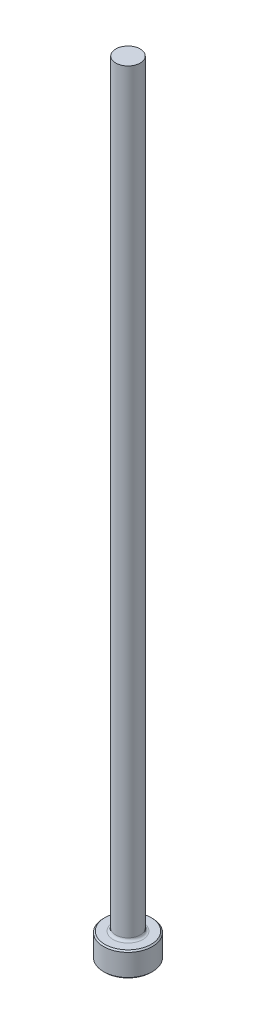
ISO-10303-21;
HEADER;
FILE_DESCRIPTION(('STEP AP214'),'2;1');
FILE_NAME('part.step','',(''),(''),'','','');
FILE_SCHEMA(('AUTOMOTIVE_DESIGN { 1 0 10303 214 1 1 1 1 }'));
ENDSEC;
DATA;
#1=APPLICATION_CONTEXT('core data for automotive mechanical design processes');
#2=APPLICATION_PROTOCOL_DEFINITION('international standard','automotive_design',2000,#1);
#3=PRODUCT_CONTEXT('',#1,'mechanical');
#4=PRODUCT('Part','Part','',(#3));
#5=PRODUCT_RELATED_PRODUCT_CATEGORY('part','',(#4));
#6=PRODUCT_DEFINITION_FORMATION('','',#4);
#7=PRODUCT_DEFINITION_CONTEXT('part definition',#1,'design');
#8=PRODUCT_DEFINITION('design','',#6,#7);
#9=PRODUCT_DEFINITION_SHAPE('','',#8);
#10=(LENGTH_UNIT() NAMED_UNIT(*) SI_UNIT(.MILLI.,.METRE.));
#11=(NAMED_UNIT(*) PLANE_ANGLE_UNIT() SI_UNIT($,.RADIAN.));
#12=(NAMED_UNIT(*) SI_UNIT($,.STERADIAN.) SOLID_ANGLE_UNIT());
#13=UNCERTAINTY_MEASURE_WITH_UNIT(LENGTH_MEASURE(1.E-05),#10,'distance_accuracy_value','');
#14=(GEOMETRIC_REPRESENTATION_CONTEXT(3) GLOBAL_UNCERTAINTY_ASSIGNED_CONTEXT((#13)) GLOBAL_UNIT_ASSIGNED_CONTEXT((#10,
#11,#12)) REPRESENTATION_CONTEXT('',''));
#15=CARTESIAN_POINT('',(0.,0.,0.));
#16=DIRECTION('',(0.,0.,1.));
#17=DIRECTION('',(1.,0.,0.));
#18=AXIS2_PLACEMENT_3D('',#15,#16,#17);
#19=CARTESIAN_POINT('',(0.,0.,0.));
#20=DIRECTION('',(0.,-1.,0.));
#21=DIRECTION('',(0.,0.,-1.));
#22=AXIS2_PLACEMENT_3D('',#19,#20,#21);
#23=PLANE('',#22);
#24=CARTESIAN_POINT('',(0.,0.,0.));
#25=DIRECTION('',(0.,-1.,0.));
#26=DIRECTION('',(0.,0.,-1.));
#27=AXIS2_PLACEMENT_3D('',#24,#25,#26);
#28=CIRCLE('',#27,4.50849999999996);
#29=CARTESIAN_POINT('',(0.,0.,-4.50849999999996));
#30=VERTEX_POINT('',#29);
#31=EDGE_CURVE('E46',#30,#30,#28,.T.);
#32=ORIENTED_EDGE('',*,*,#31,.T.);
#33=EDGE_LOOP('',(#32));
#34=FACE_BOUND('',#33,.T.);
#35=ADVANCED_FACE('F35',(#34),#23,.T.);
#36=CARTESIAN_POINT('',(0.,259.958771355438,0.));
#37=DIRECTION('',(0.,1.,0.));
#38=DIRECTION('',(0.,0.,1.));
#39=AXIS2_PLACEMENT_3D('',#36,#37,#38);
#40=CYLINDRICAL_SURFACE('',#39,4.76249999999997);
#41=CARTESIAN_POINT('',(0.,4.49579999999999,0.));
#42=DIRECTION('',(0.,1.,0.));
#43=DIRECTION('',(0.,0.,1.));
#44=AXIS2_PLACEMENT_3D('',#41,#42,#43);
#45=CIRCLE('',#44,4.76249999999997);
#46=CARTESIAN_POINT('',(0.,4.49579999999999,4.76249999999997));
#47=VERTEX_POINT('',#46);
#48=EDGE_CURVE('E50',#47,#47,#45,.F.);
#49=ORIENTED_EDGE('',*,*,#48,.T.);
#50=EDGE_LOOP('',(#49));
#51=FACE_BOUND('',#50,.T.);
#52=CARTESIAN_POINT('',(0.,0.254000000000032,0.));
#53=DIRECTION('',(0.,-1.,0.));
#54=DIRECTION('',(0.,0.,-1.));
#55=AXIS2_PLACEMENT_3D('',#52,#53,#54);
#56=CIRCLE('',#55,4.76249999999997);
#57=CARTESIAN_POINT('',(0.,0.254000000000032,-4.76249999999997));
#58=VERTEX_POINT('',#57);
#59=EDGE_CURVE('E55',#58,#58,#56,.F.);
#60=ORIENTED_EDGE('',*,*,#59,.T.);
#61=EDGE_LOOP('',(#60));
#62=FACE_BOUND('',#61,.T.);
#63=ADVANCED_FACE('F77',(#51,#62),#40,.T.);
#64=CARTESIAN_POINT('',(-4.76249999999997,4.7498,0.));
#65=DIRECTION('',(0.,1.,0.));
#66=DIRECTION('',(0.,0.,1.));
#67=AXIS2_PLACEMENT_3D('',#64,#65,#66);
#68=PLANE('',#67);
#69=CARTESIAN_POINT('',(0.,4.7498,0.));
#70=DIRECTION('',(0.,1.,0.));
#71=DIRECTION('',(0.,0.,1.));
#72=AXIS2_PLACEMENT_3D('',#69,#70,#71);
#73=CIRCLE('',#72,2.88924999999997);
#74=CARTESIAN_POINT('',(0.,4.7498,2.88924999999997));
#75=VERTEX_POINT('',#74);
#76=EDGE_CURVE('E10',#75,#75,#73,.F.);
#77=ORIENTED_EDGE('',*,*,#76,.T.);
#78=EDGE_LOOP('',(#77));
#79=FACE_BOUND('',#78,.T.);
#80=CARTESIAN_POINT('',(0.,4.7498,0.));
#81=DIRECTION('',(0.,1.,0.));
#82=DIRECTION('',(0.,0.,1.));
#83=AXIS2_PLACEMENT_3D('',#80,#81,#82);
#84=CIRCLE('',#83,4.50849999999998);
#85=CARTESIAN_POINT('',(0.,4.7498,4.50849999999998));
#86=VERTEX_POINT('',#85);
#87=EDGE_CURVE('E58',#86,#86,#84,.T.);
#88=ORIENTED_EDGE('',*,*,#87,.T.);
#89=EDGE_LOOP('',(#88));
#90=FACE_BOUND('',#89,.T.);
#91=ADVANCED_FACE('F69',(#79,#90),#68,.T.);
#92=CARTESIAN_POINT('',(0.,259.958771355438,0.));
#93=DIRECTION('',(0.,1.,0.));
#94=DIRECTION('',(0.,0.,1.));
#95=AXIS2_PLACEMENT_3D('',#92,#93,#94);
#96=CYLINDRICAL_SURFACE('',#95,2.38124999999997);
#97=CARTESIAN_POINT('',(0.,5.25779999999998,0.));
#98=DIRECTION('',(0.,1.,0.));
#99=DIRECTION('',(0.,0.,1.));
#100=AXIS2_PLACEMENT_3D('',#97,#98,#99);
#101=CIRCLE('',#100,2.38124999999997);
#102=CARTESIAN_POINT('',(0.,5.25779999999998,2.38124999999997));
#103=VERTEX_POINT('',#102);
#104=EDGE_CURVE('E42',#103,#103,#101,.T.);
#105=ORIENTED_EDGE('',*,*,#104,.T.);
#106=EDGE_LOOP('',(#105));
#107=FACE_BOUND('',#106,.T.);
#108=CARTESIAN_POINT('',(0.,152.4,0.));
#109=DIRECTION('',(0.,1.,0.));
#110=DIRECTION('',(0.,0.,1.));
#111=AXIS2_PLACEMENT_3D('',#108,#109,#110);
#112=CIRCLE('',#111,2.38124999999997);
#113=CARTESIAN_POINT('',(0.,152.4,2.38124999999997));
#114=VERTEX_POINT('',#113);
#115=EDGE_CURVE('E61',#114,#114,#112,.T.);
#116=ORIENTED_EDGE('',*,*,#115,.F.);
#117=EDGE_LOOP('',(#116));
#118=FACE_BOUND('',#117,.T.);
#119=ADVANCED_FACE('F67',(#107,#118),#96,.T.);
#120=CARTESIAN_POINT('',(-2.38124999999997,152.4,0.));
#121=DIRECTION('',(0.,1.,0.));
#122=DIRECTION('',(0.,0.,1.));
#123=AXIS2_PLACEMENT_3D('',#120,#121,#122);
#124=PLANE('',#123);
#125=ORIENTED_EDGE('',*,*,#115,.T.);
#126=EDGE_LOOP('',(#125));
#127=FACE_BOUND('',#126,.T.);
#128=ADVANCED_FACE('F65',(#127),#124,.T.);
#129=CARTESIAN_POINT('',(0.,4.74980000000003,0.));
#130=DIRECTION('',(0.,-1.,0.));
#131=DIRECTION('',(0.,0.,-1.));
#132=AXIS2_PLACEMENT_3D('',#129,#130,#131);
#133=CONICAL_SURFACE('',#132,4.50849999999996,0.785398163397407);
#134=ORIENTED_EDGE('',*,*,#48,.F.);
#135=EDGE_LOOP('',(#134));
#136=FACE_BOUND('',#135,.T.);
#137=ORIENTED_EDGE('',*,*,#87,.F.);
#138=EDGE_LOOP('',(#137));
#139=FACE_BOUND('',#138,.T.);
#140=ADVANCED_FACE('F75',(#136,#139),#133,.T.);
#141=CARTESIAN_POINT('',(0.,0.254000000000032,0.));
#142=DIRECTION('',(0.,1.,0.));
#143=DIRECTION('',(0.,0.,1.));
#144=AXIS2_PLACEMENT_3D('',#141,#142,#143);
#145=CONICAL_SURFACE('',#144,4.76249999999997,0.785398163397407);
#146=ORIENTED_EDGE('',*,*,#31,.F.);
#147=EDGE_LOOP('',(#146));
#148=FACE_BOUND('',#147,.T.);
#149=ORIENTED_EDGE('',*,*,#59,.F.);
#150=EDGE_LOOP('',(#149));
#151=FACE_BOUND('',#150,.T.);
#152=ADVANCED_FACE('F89',(#148,#151),#145,.T.);
#153=CARTESIAN_POINT('',(0.,5.25779999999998,0.));
#154=DIRECTION('',(0.,1.,0.));
#155=DIRECTION('',(0.,0.,1.));
#156=AXIS2_PLACEMENT_3D('',#153,#154,#155);
#157=TOROIDAL_SURFACE('',#156,2.88924999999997,0.508);
#158=ORIENTED_EDGE('',*,*,#76,.F.);
#159=EDGE_LOOP('',(#158));
#160=FACE_BOUND('',#159,.T.);
#161=ORIENTED_EDGE('',*,*,#104,.F.);
#162=EDGE_LOOP('',(#161));
#163=FACE_BOUND('',#162,.T.);
#164=ADVANCED_FACE('F37',(#160,#163),#157,.F.);
#165=CLOSED_SHELL('',(#35,#63,#91,#119,#128,#140,#152,#164));
#166=MANIFOLD_SOLID_BREP('B2',#165);
#167=ADVANCED_BREP_SHAPE_REPRESENTATION('',(#18,#166),#14);
#168=SHAPE_DEFINITION_REPRESENTATION(#9,#167);
ENDSEC;
END-ISO-10303-21;
